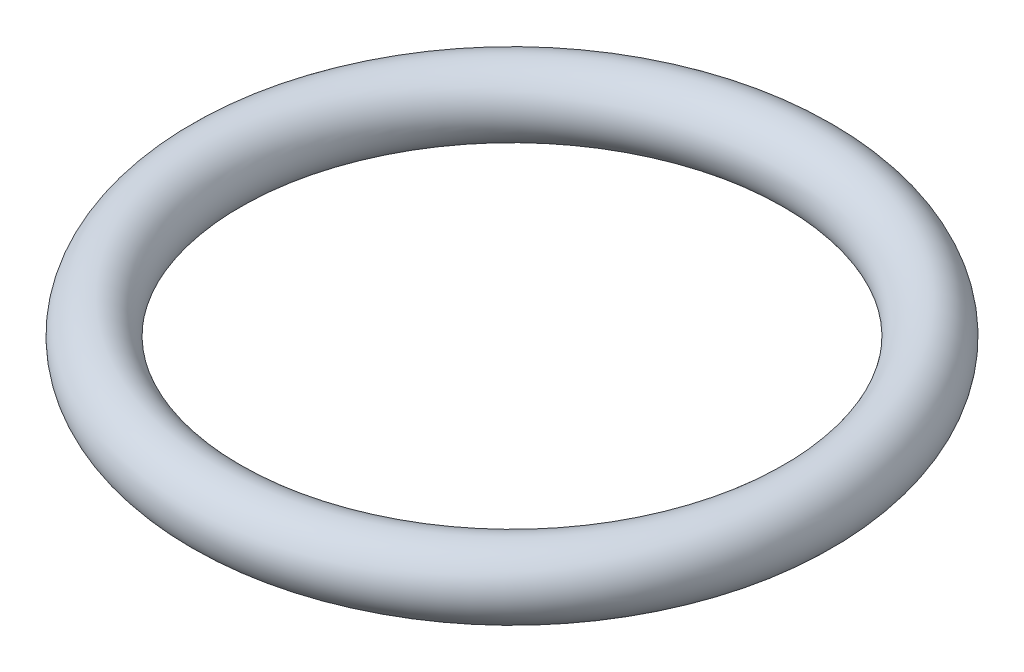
from build123d import *

# Parameters (mm, degrees)
ESQUISSE1_R = 0.5


with BuildPart() as part:
    # Esquisse1 → R_volution1 (revolve)
    with BuildSketch(Plane.XY, mode=Mode.PRIVATE) as r_volution1_sk:
        with Locations((4.35, 0)):
            Circle(ESQUISSE1_R)
    revolve(r_volution1_sk.sketch.rotate(Axis((0, 44.0096, 0), (0, -1, 0)), 90), axis=Axis((0, 44.0096, 0), (0, -1, 0)))


solid = part.part
